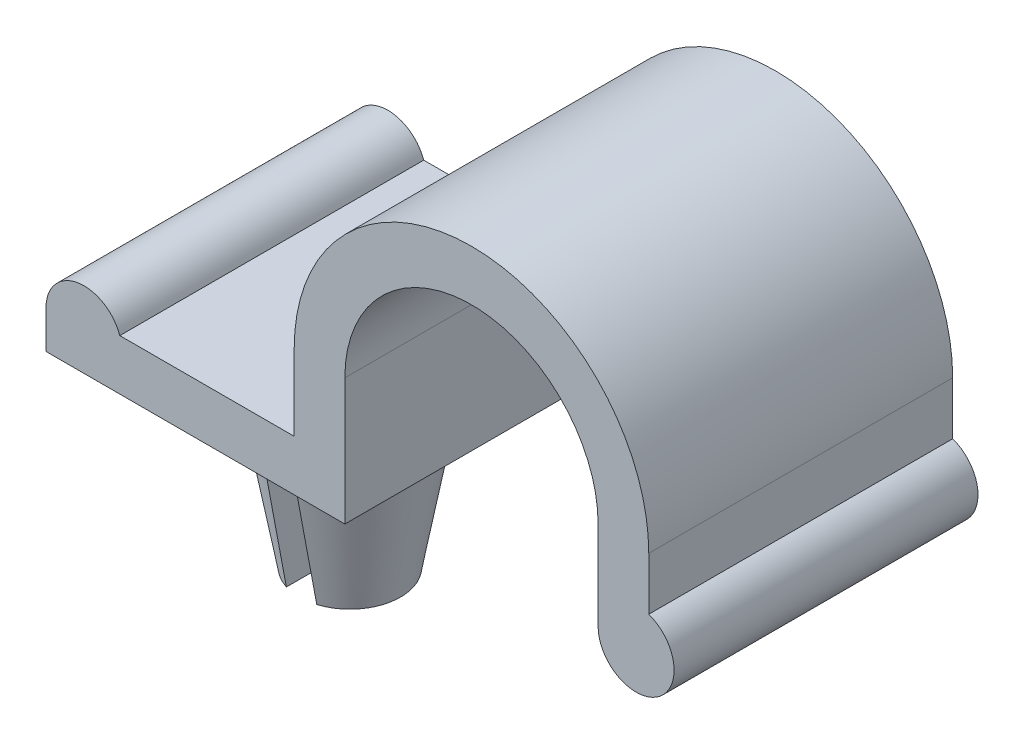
from build123d import *

# Parameters (mm, degrees)
BASE_EXTRUDE_DEPTH      = 3.81
CUT_EXTRUDE1_DEPTH      = 14.795731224
CUT_EXTRUDE1_DEPTH_BACK = 14.795731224


with BuildPart() as part:
    # Sketch1 → Base-Extrude (new, symmetric)
    with BuildSketch(Plane.XY):
        with BuildLine():
            Line((-8.817474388, -1.905), (-4.445, -1.905))
            Line((-4.445, -1.905), (-4.445, 0))
            ThreePointArc((-4.445, 0), (0, 4.445), (4.445, 0))
            Line((4.445, 0), (4.445, -1.324474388))
            ThreePointArc((4.445, -1.324474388), (4.677426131, -3.000212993), (3.175, -2.2225))
            Line((3.175, -2.2225), (3.175, 0))
            ThreePointArc((3.175, 0), (0, 3.175), (-3.175, 0))
            Line((-3.175, 0), (-3.175, -3.175))
            Line((-3.175, -3.175), (-10.668, -3.175))
            Line((-10.668, -3.175), (-10.668, -2.2225))
            ThreePointArc((-10.668, -2.2225), (-9.876569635, -1.283717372), (-8.817474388, -1.905))
        make_face()
    extrude(amount=BASE_EXTRUDE_DEPTH, both=True)

    # Sketch4 → Boss-Revolve1 (revolve)
    with BuildSketch(Plane.XY, mode=Mode.PRIVATE) as boss_revolve1_sk:
        Polygon((-6.858, -3.175), (-6.858, -7.874), (-5.588, -7.874), (-5.08, -5.08), (-5.08, -4.826), (-5.334, -4.826), (-5.334, -3.175), align=None)
    revolve(boss_revolve1_sk.sketch.rotate(Axis((-6.858, -3.175, 0), (0, 1, 0)), 90), axis=Axis((-6.858, -3.175, 0), (0, 1, 0)))

    # Sketch5 → Cut-Extrude1 (cut, two sides: drawn at the far end of the back side and taken through both)
    with BuildSketch(Plane.XY.offset(-CUT_EXTRUDE1_DEPTH_BACK)):
        with BuildLine():
            Line((-7.239, -7.874), (-6.477, -7.874))
            Line((-6.477, -7.874), (-6.477, -3.81))
            ThreePointArc((-6.477, -3.81), (-6.858, -3.429), (-7.239, -3.81))
            Line((-7.239, -3.81), (-7.239, -7.874))
        make_face()
    extrude(amount=CUT_EXTRUDE1_DEPTH + CUT_EXTRUDE1_DEPTH_BACK, mode=Mode.SUBTRACT)


solid = part.part
